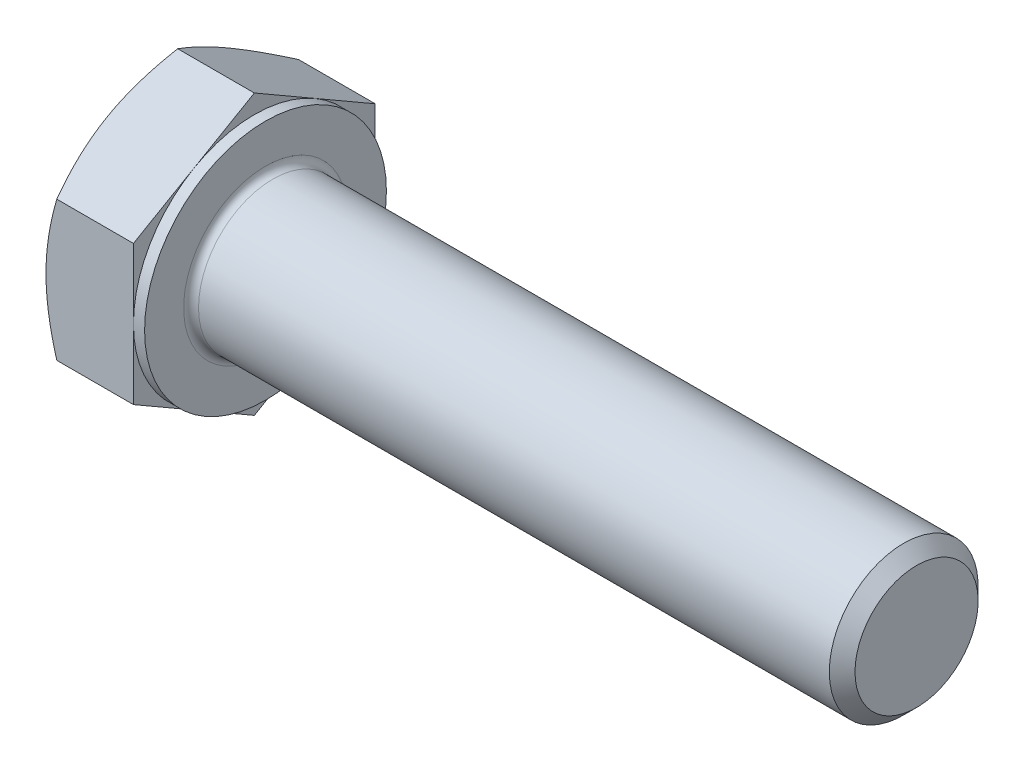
ISO-10303-21;
HEADER;
FILE_DESCRIPTION(('STEP AP214'),'2;1');
FILE_NAME('part.step','',(''),(''),'','','');
FILE_SCHEMA(('AUTOMOTIVE_DESIGN { 1 0 10303 214 1 1 1 1 }'));
ENDSEC;
DATA;
#1=APPLICATION_CONTEXT('core data for automotive mechanical design processes');
#2=APPLICATION_PROTOCOL_DEFINITION('international standard','automotive_design',2000,#1);
#3=PRODUCT_CONTEXT('',#1,'mechanical');
#4=PRODUCT('Part','Part','',(#3));
#5=PRODUCT_RELATED_PRODUCT_CATEGORY('part','',(#4));
#6=PRODUCT_DEFINITION_FORMATION('','',#4);
#7=PRODUCT_DEFINITION_CONTEXT('part definition',#1,'design');
#8=PRODUCT_DEFINITION('design','',#6,#7);
#9=PRODUCT_DEFINITION_SHAPE('','',#8);
#10=(LENGTH_UNIT() NAMED_UNIT(*) SI_UNIT(.MILLI.,.METRE.));
#11=(NAMED_UNIT(*) PLANE_ANGLE_UNIT() SI_UNIT($,.RADIAN.));
#12=(NAMED_UNIT(*) SI_UNIT($,.STERADIAN.) SOLID_ANGLE_UNIT());
#13=UNCERTAINTY_MEASURE_WITH_UNIT(LENGTH_MEASURE(1.E-05),#10,'distance_accuracy_value','');
#14=(GEOMETRIC_REPRESENTATION_CONTEXT(3) GLOBAL_UNCERTAINTY_ASSIGNED_CONTEXT((#13)) GLOBAL_UNIT_ASSIGNED_CONTEXT((#10,
#11,#12)) REPRESENTATION_CONTEXT('',''));
#15=CARTESIAN_POINT('',(0.,0.,0.));
#16=DIRECTION('',(0.,0.,1.));
#17=DIRECTION('',(1.,0.,0.));
#18=AXIS2_PLACEMENT_3D('',#15,#16,#17);
#19=CARTESIAN_POINT('',(5.3,7.50555349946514,0.));
#20=DIRECTION('',(1.,0.,0.));
#21=DIRECTION('',(0.,0.,-1.));
#22=AXIS2_PLACEMENT_3D('',#19,#20,#21);
#23=PLANE('',#22);
#24=CARTESIAN_POINT('',(5.3,0.,0.));
#25=DIRECTION('',(1.,0.,0.));
#26=DIRECTION('',(0.,0.,-1.));
#27=AXIS2_PLACEMENT_3D('',#24,#25,#26);
#28=CIRCLE('',#27,4.4);
#29=CARTESIAN_POINT('',(5.3,0.,-4.4));
#30=VERTEX_POINT('',#29);
#31=EDGE_CURVE('E38',#30,#30,#28,.F.);
#32=ORIENTED_EDGE('',*,*,#31,.T.);
#33=EDGE_LOOP('',(#32));
#34=FACE_BOUND('',#33,.T.);
#35=CARTESIAN_POINT('',(5.3,0.,0.));
#36=DIRECTION('',(1.,0.,0.));
#37=DIRECTION('',(0.,0.,-1.));
#38=AXIS2_PLACEMENT_3D('',#35,#36,#37);
#39=CIRCLE('',#38,6.5);
#40=CARTESIAN_POINT('',(5.3,0.,-6.5));
#41=VERTEX_POINT('',#40);
#42=EDGE_CURVE('E289',#41,#41,#39,.T.);
#43=ORIENTED_EDGE('',*,*,#42,.T.);
#44=EDGE_LOOP('',(#43));
#45=FACE_BOUND('',#44,.T.);
#46=ADVANCED_FACE('F30',(#34,#45),#23,.T.);
#47=CARTESIAN_POINT('',(0.,0.,0.));
#48=DIRECTION('',(-1.,0.,0.));
#49=DIRECTION('',(0.,0.,1.));
#50=AXIS2_PLACEMENT_3D('',#47,#48,#49);
#51=CYLINDRICAL_SURFACE('',#50,4.);
#52=CARTESIAN_POINT('',(5.7,0.,0.));
#53=DIRECTION('',(1.,0.,0.));
#54=DIRECTION('',(0.,0.,-1.));
#55=AXIS2_PLACEMENT_3D('',#52,#53,#54);
#56=CIRCLE('',#55,4.);
#57=CARTESIAN_POINT('',(5.7,0.,-4.));
#58=VERTEX_POINT('',#57);
#59=EDGE_CURVE('E11',#58,#58,#56,.T.);
#60=ORIENTED_EDGE('',*,*,#59,.T.);
#61=EDGE_LOOP('',(#60));
#62=FACE_BOUND('',#61,.T.);
#63=CARTESIAN_POINT('',(39.6095,0.,0.));
#64=DIRECTION('',(-1.,0.,0.));
#65=DIRECTION('',(0.,0.,1.));
#66=AXIS2_PLACEMENT_3D('',#63,#64,#65);
#67=CIRCLE('',#66,4.);
#68=CARTESIAN_POINT('',(39.6095,0.,4.));
#69=VERTEX_POINT('',#68);
#70=EDGE_CURVE('E268',#69,#69,#67,.T.);
#71=ORIENTED_EDGE('',*,*,#70,.T.);
#72=EDGE_LOOP('',(#71));
#73=FACE_BOUND('',#72,.T.);
#74=ADVANCED_FACE('F242',(#62,#73),#51,.T.);
#75=CARTESIAN_POINT('',(40.3,0.,0.));
#76=DIRECTION('',(-1.,0.,0.));
#77=DIRECTION('',(0.,0.,1.));
#78=AXIS2_PLACEMENT_3D('',#75,#76,#77);
#79=CONICAL_SURFACE('',#78,3.3095,0.785398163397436);
#80=ORIENTED_EDGE('',*,*,#70,.F.);
#81=EDGE_LOOP('',(#80));
#82=FACE_BOUND('',#81,.T.);
#83=CARTESIAN_POINT('',(40.3,0.,0.));
#84=DIRECTION('',(-1.,0.,0.));
#85=DIRECTION('',(0.,0.,1.));
#86=AXIS2_PLACEMENT_3D('',#83,#84,#85);
#87=CIRCLE('',#86,3.3095);
#88=CARTESIAN_POINT('',(40.3,0.,3.3095));
#89=VERTEX_POINT('',#88);
#90=EDGE_CURVE('E266',#89,#89,#87,.T.);
#91=ORIENTED_EDGE('',*,*,#90,.T.);
#92=EDGE_LOOP('',(#91));
#93=FACE_BOUND('',#92,.T.);
#94=ADVANCED_FACE('F247',(#82,#93),#79,.T.);
#95=CARTESIAN_POINT('',(40.3,0.,0.));
#96=DIRECTION('',(-1.,0.,0.));
#97=DIRECTION('',(0.,0.,1.));
#98=AXIS2_PLACEMENT_3D('',#95,#96,#97);
#99=PLANE('',#98);
#100=ORIENTED_EDGE('',*,*,#90,.F.);
#101=EDGE_LOOP('',(#100));
#102=FACE_BOUND('',#101,.T.);
#103=ADVANCED_FACE('F254',(#102),#99,.F.);
#104=CARTESIAN_POINT('',(4.7,6.5,0.));
#105=DIRECTION('',(1.,0.,0.));
#106=DIRECTION('',(0.,0.,-1.));
#107=AXIS2_PLACEMENT_3D('',#104,#105,#106);
#108=PLANE('',#107);
#109=DIRECTION('',(0.,0.500000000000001,0.866025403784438));
#110=VECTOR('',#109,1.);
#111=CARTESIAN_POINT('',(4.7,3.75277674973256,-6.5));
#112=LINE('',#111,#110);
#113=CARTESIAN_POINT('',(4.7,3.75277674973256,-6.5));
#114=VERTEX_POINT('',#113);
#115=CARTESIAN_POINT('',(4.7,5.62916512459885,-3.25000000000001));
#116=VERTEX_POINT('',#115);
#117=EDGE_CURVE('E162',#114,#116,#112,.T.);
#118=ORIENTED_EDGE('',*,*,#117,.T.);
#119=CARTESIAN_POINT('',(4.7,0.,0.));
#120=DIRECTION('',(-1.,0.,0.));
#121=DIRECTION('',(0.,0.,1.));
#122=AXIS2_PLACEMENT_3D('',#119,#120,#121);
#123=CIRCLE('',#122,6.5);
#124=CARTESIAN_POINT('',(4.7,0.,-6.5));
#125=VERTEX_POINT('',#124);
#126=EDGE_CURVE('E45',#116,#125,#123,.T.);
#127=ORIENTED_EDGE('',*,*,#126,.T.);
#128=DIRECTION('',(0.,1.,0.));
#129=VECTOR('',#128,1.);
#130=CARTESIAN_POINT('',(4.7,3.75277674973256,-6.5));
#131=LINE('',#130,#129);
#132=EDGE_CURVE('E292',#125,#114,#131,.T.);
#133=ORIENTED_EDGE('',*,*,#132,.T.);
#134=EDGE_LOOP('',(#118,#127,#133));
#135=FACE_BOUND('',#134,.T.);
#136=ADVANCED_FACE('F257',(#135),#108,.T.);
#137=CARTESIAN_POINT('',(4.7,7.50555349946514,0.));
#138=VERTEX_POINT('',#137);
#139=EDGE_CURVE('E160',#116,#138,#112,.T.);
#140=ORIENTED_EDGE('',*,*,#139,.T.);
#141=DIRECTION('',(0.,-0.500000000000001,0.866025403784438));
#142=VECTOR('',#141,1.);
#143=CARTESIAN_POINT('',(4.7,7.50555349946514,0.));
#144=LINE('',#143,#142);
#145=CARTESIAN_POINT('',(4.7,5.62916512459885,3.25000000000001));
#146=VERTEX_POINT('',#145);
#147=EDGE_CURVE('E159',#138,#146,#144,.T.);
#148=ORIENTED_EDGE('',*,*,#147,.T.);
#149=EDGE_CURVE('E148',#146,#116,#123,.T.);
#150=ORIENTED_EDGE('',*,*,#149,.T.);
#151=EDGE_LOOP('',(#140,#148,#150));
#152=FACE_BOUND('',#151,.T.);
#153=ADVANCED_FACE('F262',(#152),#108,.T.);
#154=CARTESIAN_POINT('',(4.7,3.75277674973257,6.5));
#155=VERTEX_POINT('',#154);
#156=EDGE_CURVE('E127',#146,#155,#144,.T.);
#157=ORIENTED_EDGE('',*,*,#156,.T.);
#158=DIRECTION('',(0.,-1.,0.));
#159=VECTOR('',#158,1.);
#160=CARTESIAN_POINT('',(4.7,3.75277674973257,6.5));
#161=LINE('',#160,#159);
#162=CARTESIAN_POINT('',(4.7,0.,6.5));
#163=VERTEX_POINT('',#162);
#164=EDGE_CURVE('E121',#155,#163,#161,.T.);
#165=ORIENTED_EDGE('',*,*,#164,.T.);
#166=EDGE_CURVE('E125',#163,#146,#123,.T.);
#167=ORIENTED_EDGE('',*,*,#166,.T.);
#168=EDGE_LOOP('',(#157,#165,#167));
#169=FACE_BOUND('',#168,.T.);
#170=ADVANCED_FACE('F123',(#169),#108,.T.);
#171=CARTESIAN_POINT('',(4.7,-3.75277674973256,6.5));
#172=VERTEX_POINT('',#171);
#173=EDGE_CURVE('E131',#163,#172,#161,.T.);
#174=ORIENTED_EDGE('',*,*,#173,.T.);
#175=DIRECTION('',(0.,-0.500000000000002,-0.866025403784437));
#176=VECTOR('',#175,1.);
#177=CARTESIAN_POINT('',(4.7,-7.50555349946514,0.));
#178=LINE('',#177,#176);
#179=CARTESIAN_POINT('',(4.7,-5.62916512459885,3.25000000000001));
#180=VERTEX_POINT('',#179);
#181=EDGE_CURVE('E138',#172,#180,#178,.T.);
#182=ORIENTED_EDGE('',*,*,#181,.T.);
#183=EDGE_CURVE('E135',#180,#163,#123,.T.);
#184=ORIENTED_EDGE('',*,*,#183,.T.);
#185=EDGE_LOOP('',(#174,#182,#184));
#186=FACE_BOUND('',#185,.T.);
#187=ADVANCED_FACE('F136',(#186),#108,.T.);
#188=CARTESIAN_POINT('',(4.7,-7.50555349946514,0.));
#189=VERTEX_POINT('',#188);
#190=EDGE_CURVE('E154',#180,#189,#178,.T.);
#191=ORIENTED_EDGE('',*,*,#190,.T.);
#192=DIRECTION('',(0.,0.5,-0.866025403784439));
#193=VECTOR('',#192,1.);
#194=CARTESIAN_POINT('',(4.7,-3.75277674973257,-6.5));
#195=LINE('',#194,#193);
#196=CARTESIAN_POINT('',(4.7,-5.62916512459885,-3.25));
#197=VERTEX_POINT('',#196);
#198=EDGE_CURVE('E330',#189,#197,#195,.T.);
#199=ORIENTED_EDGE('',*,*,#198,.T.);
#200=EDGE_CURVE('E142',#197,#180,#123,.T.);
#201=ORIENTED_EDGE('',*,*,#200,.T.);
#202=EDGE_LOOP('',(#191,#199,#201));
#203=FACE_BOUND('',#202,.T.);
#204=ADVANCED_FACE('F331',(#203),#108,.T.);
#205=CARTESIAN_POINT('',(4.7,-3.75277674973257,-6.5));
#206=VERTEX_POINT('',#205);
#207=EDGE_CURVE('E149',#197,#206,#195,.T.);
#208=ORIENTED_EDGE('',*,*,#207,.T.);
#209=EDGE_CURVE('E293',#206,#125,#131,.T.);
#210=ORIENTED_EDGE('',*,*,#209,.T.);
#211=EDGE_CURVE('E300',#125,#197,#123,.T.);
#212=ORIENTED_EDGE('',*,*,#211,.T.);
#213=EDGE_LOOP('',(#208,#210,#212));
#214=FACE_BOUND('',#213,.T.);
#215=ADVANCED_FACE('F263',(#214),#108,.T.);
#216=CARTESIAN_POINT('',(0.,0.,0.));
#217=DIRECTION('',(-1.,0.,0.));
#218=DIRECTION('',(0.,0.,1.));
#219=AXIS2_PLACEMENT_3D('',#216,#217,#218);
#220=CYLINDRICAL_SURFACE('',#219,6.5);
#221=ORIENTED_EDGE('',*,*,#126,.F.);
#222=ORIENTED_EDGE('',*,*,#149,.F.);
#223=ORIENTED_EDGE('',*,*,#166,.F.);
#224=ORIENTED_EDGE('',*,*,#183,.F.);
#225=ORIENTED_EDGE('',*,*,#200,.F.);
#226=ORIENTED_EDGE('',*,*,#211,.F.);
#227=EDGE_LOOP('',(#221,#222,#223,#224,#225,#226));
#228=FACE_BOUND('',#227,.T.);
#229=ORIENTED_EDGE('',*,*,#42,.F.);
#230=EDGE_LOOP('',(#229));
#231=FACE_BOUND('',#230,.T.);
#232=ADVANCED_FACE('F145',(#228,#231),#220,.T.);
#233=CARTESIAN_POINT('',(0.,7.50555349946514,0.));
#234=DIRECTION('',(1.,0.,0.));
#235=DIRECTION('',(0.,0.,-1.));
#236=AXIS2_PLACEMENT_3D('',#233,#234,#235);
#237=PLANE('',#236);
#238=CARTESIAN_POINT('',(0.,0.,0.));
#239=DIRECTION('',(1.,0.,0.));
#240=DIRECTION('',(0.,0.,-1.));
#241=AXIS2_PLACEMENT_3D('',#238,#239,#240);
#242=CIRCLE('',#241,6.5);
#243=CARTESIAN_POINT('',(0.,0.,-6.5));
#244=VERTEX_POINT('',#243);
#245=CARTESIAN_POINT('',(0.,5.62916512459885,-3.25000000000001));
#246=VERTEX_POINT('',#245);
#247=EDGE_CURVE('E288',#244,#246,#242,.T.);
#248=ORIENTED_EDGE('',*,*,#247,.F.);
#249=CARTESIAN_POINT('',(0.,-5.62916512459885,-3.25));
#250=VERTEX_POINT('',#249);
#251=EDGE_CURVE('E284',#250,#244,#242,.T.);
#252=ORIENTED_EDGE('',*,*,#251,.F.);
#253=CARTESIAN_POINT('',(0.,-5.62916512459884,3.25000000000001));
#254=VERTEX_POINT('',#253);
#255=EDGE_CURVE('E287',#254,#250,#242,.T.);
#256=ORIENTED_EDGE('',*,*,#255,.F.);
#257=CARTESIAN_POINT('',(0.,0.,6.5));
#258=VERTEX_POINT('',#257);
#259=EDGE_CURVE('E323',#258,#254,#242,.T.);
#260=ORIENTED_EDGE('',*,*,#259,.F.);
#261=CARTESIAN_POINT('',(0.,0.,0.));
#262=DIRECTION('',(-1.,0.,0.));
#263=DIRECTION('',(0.,0.,1.));
#264=AXIS2_PLACEMENT_3D('',#261,#262,#263);
#265=CIRCLE('',#264,6.5);
#266=CARTESIAN_POINT('',(0.,5.62916512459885,3.25));
#267=VERTEX_POINT('',#266);
#268=EDGE_CURVE('E163',#258,#267,#265,.T.);
#269=ORIENTED_EDGE('',*,*,#268,.T.);
#270=EDGE_CURVE('E346',#246,#267,#242,.T.);
#271=ORIENTED_EDGE('',*,*,#270,.F.);
#272=EDGE_LOOP('',(#248,#252,#256,#260,#269,#271));
#273=FACE_BOUND('',#272,.T.);
#274=ADVANCED_FACE('F192',(#273),#237,.F.);
#275=CARTESIAN_POINT('',(0.,0.,0.));
#276=DIRECTION('',(1.,0.,0.));
#277=DIRECTION('',(0.,0.,-1.));
#278=AXIS2_PLACEMENT_3D('',#275,#276,#277);
#279=CONICAL_SURFACE('',#278,6.5,1.0471975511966);
#280=CARTESIAN_POINT('',(0.580623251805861,3.75266127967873,6.5002));
#281=CARTESIAN_POINT('',(0.53300442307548,3.8351516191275,6.35732254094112));
#282=CARTESIAN_POINT('',(0.487546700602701,3.91794952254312,6.21391236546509));
#283=CARTESIAN_POINT('',(0.401548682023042,4.08421773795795,5.9259273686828));
#284=CARTESIAN_POINT('',(0.361010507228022,4.16768832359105,5.78135207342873));
#285=CARTESIAN_POINT('',(0.247571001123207,4.41943655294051,5.34531134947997));
#286=CARTESIAN_POINT('',(0.183047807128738,4.58870793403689,5.05212471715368));
#287=CARTESIAN_POINT('',(0.107386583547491,4.84201947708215,4.61337625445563));
#288=CARTESIAN_POINT('',(0.0858328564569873,4.92530276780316,4.46912536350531));
#289=CARTESIAN_POINT('',(0.0496903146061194,5.09224566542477,4.17997178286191));
#290=CARTESIAN_POINT('',(0.0351008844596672,5.17590523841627,4.03506915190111));
#291=CARTESIAN_POINT('',(0.0132587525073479,5.34336968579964,3.74501222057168));
#292=CARTESIAN_POINT('',(0.00599772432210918,5.427174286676,3.59985839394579));
#293=CARTESIAN_POINT('',(-0.00103969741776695,5.59485627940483,3.30942466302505));
#294=CARTESIAN_POINT('',(-0.00081632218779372,5.6787336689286,3.16414476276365));
#295=CARTESIAN_POINT('',(0.0100834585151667,5.90853103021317,2.76612405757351));
#296=CARTESIAN_POINT('',(0.0283818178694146,6.05437578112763,2.51351353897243));
#297=CARTESIAN_POINT('',(0.0864063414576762,6.34509659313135,2.00997032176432));
#298=CARTESIAN_POINT('',(0.126152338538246,6.48997163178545,1.75903939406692));
#299=CARTESIAN_POINT('',(0.22550590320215,6.78127752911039,1.25448277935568));
#300=CARTESIAN_POINT('',(0.285534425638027,6.92767163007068,1.00092075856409));
#301=CARTESIAN_POINT('',(0.421774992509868,7.21827667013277,0.497578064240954));
#302=CARTESIAN_POINT('',(0.497955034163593,7.36249133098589,0.247790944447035));
#303=CARTESIAN_POINT('',(0.580623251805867,7.50566896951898,-0.000200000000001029));
#304=B_SPLINE_CURVE_WITH_KNOTS('',3,(#280,#281,#282,#283,#284,#285,#286,#287,#288,#289,#290,
#291,#292,#293,#294,#295,#296,#297,#298,#299,#300,#301,#302,#303),.UNSPECIFIED.,.F.,.F.,(4,2,2,
2,2,2,2,2,2,2,2,4),(0.,0.515105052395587,1.03043143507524,2.06322554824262,2.56697389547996,
3.07067772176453,3.57380860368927,4.07692394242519,4.9527935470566,5.82947446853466,
6.72559912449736,7.61996451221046),.UNSPECIFIED.);
#305=CARTESIAN_POINT('',(0.580556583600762,7.50555349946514,0.));
#306=VERTEX_POINT('',#305);
#307=EDGE_CURVE('E211',#267,#306,#304,.T.);
#308=ORIENTED_EDGE('',*,*,#307,.T.);
#309=CARTESIAN_POINT('',(0.580623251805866,7.50566896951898,0.000200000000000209));
#310=CARTESIAN_POINT('',(0.533004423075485,7.4231786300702,-0.14267745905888));
#311=CARTESIAN_POINT('',(0.487546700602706,7.34038072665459,-0.286087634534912));
#312=CARTESIAN_POINT('',(0.401548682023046,7.17411251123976,-0.574072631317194));
#313=CARTESIAN_POINT('',(0.361010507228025,7.09064192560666,-0.718647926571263));
#314=CARTESIAN_POINT('',(0.247571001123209,6.83889369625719,-1.15468865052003));
#315=CARTESIAN_POINT('',(0.18304780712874,6.66962231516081,-1.44787528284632));
#316=CARTESIAN_POINT('',(0.107386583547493,6.41631077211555,-1.88662374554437));
#317=CARTESIAN_POINT('',(0.085832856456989,6.33302748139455,-2.03087463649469));
#318=CARTESIAN_POINT('',(0.0496903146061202,6.16608458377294,-2.32002821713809));
#319=CARTESIAN_POINT('',(0.0351008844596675,6.08242501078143,-2.46493084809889));
#320=CARTESIAN_POINT('',(0.0132587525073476,5.91496056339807,-2.75498777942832));
#321=CARTESIAN_POINT('',(0.00599772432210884,5.83115596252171,-2.90014160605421));
#322=CARTESIAN_POINT('',(-0.00103969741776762,5.66347396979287,-3.19057533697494));
#323=CARTESIAN_POINT('',(-0.000816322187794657,5.5795965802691,-3.33585523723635));
#324=CARTESIAN_POINT('',(0.0100834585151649,5.34979921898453,-3.73387594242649));
#325=CARTESIAN_POINT('',(0.028381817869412,5.20395446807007,-3.98648646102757));
#326=CARTESIAN_POINT('',(0.0864063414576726,4.91323365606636,-4.49002967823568));
#327=CARTESIAN_POINT('',(0.126152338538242,4.76835861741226,-4.74096060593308));
#328=CARTESIAN_POINT('',(0.225505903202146,4.47705272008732,-5.24551722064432));
#329=CARTESIAN_POINT('',(0.285534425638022,4.33065861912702,-5.49907924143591));
#330=CARTESIAN_POINT('',(0.421774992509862,4.04005357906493,-6.00242193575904));
#331=CARTESIAN_POINT('',(0.497955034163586,3.89583891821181,-6.25220905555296));
#332=CARTESIAN_POINT('',(0.58062325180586,3.75266127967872,-6.5002));
#333=B_SPLINE_CURVE_WITH_KNOTS('',3,(#309,#310,#311,#312,#313,#314,#315,#316,#317,#318,#319,
#320,#321,#322,#323,#324,#325,#326,#327,#328,#329,#330,#331,#332),.UNSPECIFIED.,.F.,.F.,(4,2,2,
2,2,2,2,2,2,2,2,4),(0.,0.515105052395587,1.03043143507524,2.06322554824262,2.56697389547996,
3.07067772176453,3.57380860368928,4.0769239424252,4.9527935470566,5.82947446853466,
6.72559912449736,7.61996451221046),.UNSPECIFIED.);
#334=EDGE_CURVE('E53',#306,#246,#333,.T.);
#335=ORIENTED_EDGE('',*,*,#334,.T.);
#336=ORIENTED_EDGE('',*,*,#270,.T.);
#337=EDGE_LOOP('',(#308,#335,#336));
#338=FACE_BOUND('',#337,.T.);
#339=ADVANCED_FACE('F347',(#338),#279,.T.);
#340=CARTESIAN_POINT('',(3.18835311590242,-10.1137456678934,6.5));
#341=CARTESIAN_POINT('',(3.05034774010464,-9.82952666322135,6.5));
#342=CARTESIAN_POINT('',(2.91365616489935,-9.54465869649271,6.5));
#343=CARTESIAN_POINT('',(2.64363899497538,-8.97327978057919,6.5));
#344=CARTESIAN_POINT('',(2.51031392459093,-8.68676858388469,6.5));
#345=CARTESIAN_POINT('',(2.24710473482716,-8.11029837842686,6.5));
#346=CARTESIAN_POINT('',(2.11724300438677,-7.82032911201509,6.5));
#347=CARTESIAN_POINT('',(1.862790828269,-7.23809541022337,6.5));
#348=CARTESIAN_POINT('',(1.73820013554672,-6.94583108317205,6.5));
#349=CARTESIAN_POINT('',(1.49176685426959,-6.34906440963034,6.5));
#350=CARTESIAN_POINT('',(1.37014257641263,-6.0444714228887,6.5));
#351=CARTESIAN_POINT('',(1.13601865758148,-5.43173420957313,6.5));
#352=CARTESIAN_POINT('',(1.02352003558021,-5.12358959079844,6.5));
#353=CARTESIAN_POINT('',(0.810575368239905,-4.50382569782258,6.5));
#354=CARTESIAN_POINT('',(0.710105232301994,-4.19221478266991,6.5));
#355=CARTESIAN_POINT('',(0.524420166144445,-3.5645201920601,6.5));
#356=CARTESIAN_POINT('',(0.43920046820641,-3.24843794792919,6.5));
#357=CARTESIAN_POINT('',(0.288524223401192,-2.61335465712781,6.5));
#358=CARTESIAN_POINT('',(0.222961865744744,-2.29437912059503,6.5));
#359=CARTESIAN_POINT('',(0.115312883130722,-1.65238219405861,6.5));
#360=CARTESIAN_POINT('',(0.0732239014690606,-1.32936121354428,6.5));
#361=CARTESIAN_POINT('',(0.0304887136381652,-0.845231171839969,6.5));
#362=CARTESIAN_POINT('',(0.0196493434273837,-0.684982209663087,6.5));
#363=CARTESIAN_POINT('',(0.00475298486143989,-0.364162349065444,6.5));
#364=CARTESIAN_POINT('',(0.000695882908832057,-0.203591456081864,6.5));
#365=CARTESIAN_POINT('',(-0.000531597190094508,0.117577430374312,6.5));
#366=CARTESIAN_POINT('',(0.00229809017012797,0.278175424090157,6.5));
#367=CARTESIAN_POINT('',(0.0147726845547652,0.599108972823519,6.5));
#368=CARTESIAN_POINT('',(0.0244179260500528,0.759444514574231,6.5));
#369=CARTESIAN_POINT('',(0.0554961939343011,1.14369946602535,6.5));
#370=CARTESIAN_POINT('',(0.0801030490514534,1.36736763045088,6.5));
#371=CARTESIAN_POINT('',(0.14124653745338,1.8130559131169,6.5));
#372=CARTESIAN_POINT('',(0.177784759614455,2.03507580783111,6.5));
#373=CARTESIAN_POINT('',(0.30336000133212,2.69839633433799,6.5));
#374=CARTESIAN_POINT('',(0.408335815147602,3.13672010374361,6.5));
#375=CARTESIAN_POINT('',(0.59056459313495,3.79232112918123,6.5));
#376=CARTESIAN_POINT('',(0.656313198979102,4.01299150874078,6.5));
#377=CARTESIAN_POINT('',(0.794681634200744,4.45218859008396,6.5));
#378=CARTESIAN_POINT('',(0.86730151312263,4.67071527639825,6.5));
#379=CARTESIAN_POINT('',(1.01824353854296,5.10569490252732,6.5));
#380=CARTESIAN_POINT('',(1.0965638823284,5.32214847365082,6.5));
#381=CARTESIAN_POINT('',(1.25798086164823,5.75325725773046,6.5));
#382=CARTESIAN_POINT('',(1.34107741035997,5.96791250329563,6.5));
#383=CARTESIAN_POINT('',(1.56029019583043,6.5188844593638,6.5));
#384=CARTESIAN_POINT('',(1.69936356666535,6.85402316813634,6.5));
#385=CARTESIAN_POINT('',(1.98501958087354,7.521095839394,6.5));
#386=CARTESIAN_POINT('',(2.13160288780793,7.85302951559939,6.5));
#387=CARTESIAN_POINT('',(2.43059748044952,8.51437865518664,6.5));
#388=CARTESIAN_POINT('',(2.5830105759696,8.843793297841,6.5));
#389=CARTESIAN_POINT('',(2.89234869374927,9.5004779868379,6.5));
#390=CARTESIAN_POINT('',(3.04927357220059,9.82774810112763,6.5));
#391=CARTESIAN_POINT('',(3.36692013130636,10.4809971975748,6.5));
#392=CARTESIAN_POINT('',(3.52764676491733,10.8069737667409,6.5));
#393=CARTESIAN_POINT('',(3.85198555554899,11.4574882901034,6.5));
#394=CARTESIAN_POINT('',(4.01559773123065,11.7820262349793,6.5));
#395=CARTESIAN_POINT('',(4.50986185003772,12.7537468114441,6.5));
#396=CARTESIAN_POINT('',(4.84399997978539,13.3991555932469,6.5));
#397=CARTESIAN_POINT('',(5.48575990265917,14.6239779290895,6.5));
#398=CARTESIAN_POINT('',(5.79279643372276,15.2036995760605,6.5));
#399=CARTESIAN_POINT('',(6.41069188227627,16.3611382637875,6.5));
#400=CARTESIAN_POINT('',(6.72155099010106,16.9388552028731,6.49999999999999));
#401=CARTESIAN_POINT('',(7.34519775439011,18.0910273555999,6.49999999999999));
#402=CARTESIAN_POINT('',(7.6579769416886,18.6654871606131,6.49999999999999));
#403=CARTESIAN_POINT('',(8.28574397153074,19.8131486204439,6.49999999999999));
#404=CARTESIAN_POINT('',(8.60073166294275,20.3863503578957,6.49999999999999));
#405=CARTESIAN_POINT('',(8.91652967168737,20.9591024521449,6.49999999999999));
#406=B_SPLINE_CURVE_WITH_KNOTS('',3,(#340,#341,#342,#343,#344,#345,#346,#347,#348,#349,#350,
#351,#352,#353,#354,#355,#356,#357,#358,#359,#360,#361,#362,#363,#364,#365,#366,#367,#368,#369,
#370,#371,#372,#373,#374,#375,#376,#377,#378,#379,#380,#381,#382,#383,#384,#385,#386,#387,#388,
#389,#390,#391,#392,#393,#394,#395,#396,#397,#398,#399,#400,#401,#402,#403,#404,#405),
.UNSPECIFIED.,.F.,.F.,(4,2,2,2,2,2,2,2,2,2,2,2,2,2,2,2,2,2,2,2,2,2,2,2,2,2,2,2,2,2,2,2,4),(0.,
0.947868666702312,1.89588406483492,2.84900320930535,3.80207763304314,4.7858977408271,
5.76982755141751,6.75175256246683,7.73337005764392,8.70960474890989,9.68574140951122,
10.1674651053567,10.6491807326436,11.1309009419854,11.6126447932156,12.287317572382,
12.9620802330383,14.312318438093,15.0030310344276,15.6937486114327,16.3842486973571,
17.0747362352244,18.1631508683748,19.2516618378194,20.3405135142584,21.429330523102,
22.5196540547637,23.6099846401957,25.7902468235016,27.7582608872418,29.7263733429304,
31.6886408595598,33.6507753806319),.UNSPECIFIED.);
#407=CARTESIAN_POINT('',(0.580556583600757,3.75277674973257,6.5));
#408=VERTEX_POINT('',#407);
#409=EDGE_CURVE('E223',#258,#408,#406,.T.);
#410=ORIENTED_EDGE('',*,*,#409,.T.);
#411=EDGE_CURVE('E222',#408,#267,#304,.T.);
#412=ORIENTED_EDGE('',*,*,#411,.T.);
#413=ORIENTED_EDGE('',*,*,#268,.F.);
#414=EDGE_LOOP('',(#410,#412,#413));
#415=FACE_BOUND('',#414,.T.);
#416=ADVANCED_FACE('F317',(#415),#279,.T.);
#417=CARTESIAN_POINT('',(0.580556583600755,-3.75277674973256,6.5));
#418=VERTEX_POINT('',#417);
#419=EDGE_CURVE('E269',#418,#258,#406,.T.);
#420=ORIENTED_EDGE('',*,*,#419,.T.);
#421=ORIENTED_EDGE('',*,*,#259,.T.);
#422=CARTESIAN_POINT('',(0.580623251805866,-7.50566896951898,-0.000200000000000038));
#423=CARTESIAN_POINT('',(0.533004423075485,-7.4231786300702,0.14267745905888));
#424=CARTESIAN_POINT('',(0.487546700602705,-7.34038072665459,0.286087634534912));
#425=CARTESIAN_POINT('',(0.401548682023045,-7.17411251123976,0.574072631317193));
#426=CARTESIAN_POINT('',(0.361010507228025,-7.09064192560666,0.718647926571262));
#427=CARTESIAN_POINT('',(0.247571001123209,-6.83889369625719,1.15468865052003));
#428=CARTESIAN_POINT('',(0.18304780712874,-6.66962231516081,1.44787528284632));
#429=CARTESIAN_POINT('',(0.107386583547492,-6.41631077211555,1.88662374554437));
#430=CARTESIAN_POINT('',(0.085832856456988,-6.33302748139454,2.03087463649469));
#431=CARTESIAN_POINT('',(0.0496903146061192,-6.16608458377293,2.32002821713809));
#432=CARTESIAN_POINT('',(0.0351008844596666,-6.08242501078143,2.46493084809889));
#433=CARTESIAN_POINT('',(0.0132587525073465,-5.91496056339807,2.75498777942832));
#434=CARTESIAN_POINT('',(0.00599772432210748,-5.8311559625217,2.90014160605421));
#435=CARTESIAN_POINT('',(-0.00103969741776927,-5.66347396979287,3.19057533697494));
#436=CARTESIAN_POINT('',(-0.000816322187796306,-5.5795965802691,3.33585523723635));
#437=CARTESIAN_POINT('',(0.0100834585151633,-5.34979921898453,3.73387594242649));
#438=CARTESIAN_POINT('',(0.0283818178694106,-5.20395446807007,3.98648646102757));
#439=CARTESIAN_POINT('',(0.0864063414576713,-4.91323365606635,4.49002967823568));
#440=CARTESIAN_POINT('',(0.126152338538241,-4.76835861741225,4.74096060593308));
#441=CARTESIAN_POINT('',(0.225505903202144,-4.47705272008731,5.24551722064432));
#442=CARTESIAN_POINT('',(0.285534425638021,-4.33065861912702,5.49907924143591));
#443=CARTESIAN_POINT('',(0.421774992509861,-4.04005357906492,6.00242193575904));
#444=CARTESIAN_POINT('',(0.497955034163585,-3.8958389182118,6.25220905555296));
#445=CARTESIAN_POINT('',(0.580623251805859,-3.75266127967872,6.5002));
#446=B_SPLINE_CURVE_WITH_KNOTS('',3,(#422,#423,#424,#425,#426,#427,#428,#429,#430,#431,#432,
#433,#434,#435,#436,#437,#438,#439,#440,#441,#442,#443,#444,#445),.UNSPECIFIED.,.F.,.F.,(4,2,2,
2,2,2,2,2,2,2,2,4),(0.,0.515105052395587,1.03043143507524,2.06322554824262,2.56697389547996,
3.07067772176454,3.57380860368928,4.0769239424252,4.9527935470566,5.82947446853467,
6.72559912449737,7.61996451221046),.UNSPECIFIED.);
#447=EDGE_CURVE('E213',#254,#418,#446,.T.);
#448=ORIENTED_EDGE('',*,*,#447,.T.);
#449=EDGE_LOOP('',(#420,#421,#448));
#450=FACE_BOUND('',#449,.T.);
#451=ADVANCED_FACE('F181',(#450),#279,.T.);
#452=CARTESIAN_POINT('',(0.580556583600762,-7.50555349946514,0.));
#453=VERTEX_POINT('',#452);
#454=EDGE_CURVE('E206',#453,#254,#446,.T.);
#455=ORIENTED_EDGE('',*,*,#454,.T.);
#456=ORIENTED_EDGE('',*,*,#255,.T.);
#457=CARTESIAN_POINT('',(0.580623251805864,-3.75266127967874,-6.5002));
#458=CARTESIAN_POINT('',(0.533004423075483,-3.83515161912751,-6.35732254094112));
#459=CARTESIAN_POINT('',(0.487546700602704,-3.91794952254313,-6.21391236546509));
#460=CARTESIAN_POINT('',(0.401548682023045,-4.08421773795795,-5.9259273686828));
#461=CARTESIAN_POINT('',(0.361010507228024,-4.16768832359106,-5.78135207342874));
#462=CARTESIAN_POINT('',(0.247571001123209,-4.41943655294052,-5.34531134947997));
#463=CARTESIAN_POINT('',(0.18304780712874,-4.5887079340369,-5.05212471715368));
#464=CARTESIAN_POINT('',(0.107386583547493,-4.84201947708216,-4.61337625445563));
#465=CARTESIAN_POINT('',(0.0858328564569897,-4.92530276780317,-4.46912536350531));
#466=CARTESIAN_POINT('',(0.0496903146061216,-5.09224566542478,-4.17997178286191));
#467=CARTESIAN_POINT('',(0.0351008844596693,-5.17590523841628,-4.03506915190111));
#468=CARTESIAN_POINT('',(0.0132587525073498,-5.34336968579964,-3.74501222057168));
#469=CARTESIAN_POINT('',(0.00599772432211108,-5.427174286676,-3.59985839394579));
#470=CARTESIAN_POINT('',(-0.00103969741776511,-5.59485627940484,-3.30942466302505));
#471=CARTESIAN_POINT('',(-0.000816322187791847,-5.67873366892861,-3.16414476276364));
#472=CARTESIAN_POINT('',(0.0100834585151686,-5.90853103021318,-2.76612405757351));
#473=CARTESIAN_POINT('',(0.0283818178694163,-6.05437578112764,-2.51351353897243));
#474=CARTESIAN_POINT('',(0.0864063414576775,-6.34509659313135,-2.00997032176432));
#475=CARTESIAN_POINT('',(0.126152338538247,-6.48997163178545,-1.75903939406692));
#476=CARTESIAN_POINT('',(0.225505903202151,-6.78127752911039,-1.25448277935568));
#477=CARTESIAN_POINT('',(0.285534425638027,-6.92767163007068,-1.00092075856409));
#478=CARTESIAN_POINT('',(0.421774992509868,-7.21827667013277,-0.497578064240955));
#479=CARTESIAN_POINT('',(0.497955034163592,-7.36249133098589,-0.247790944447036));
#480=CARTESIAN_POINT('',(0.580623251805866,-7.50566896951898,0.000200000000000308));
#481=B_SPLINE_CURVE_WITH_KNOTS('',3,(#457,#458,#459,#460,#461,#462,#463,#464,#465,#466,#467,
#468,#469,#470,#471,#472,#473,#474,#475,#476,#477,#478,#479,#480),.UNSPECIFIED.,.F.,.F.,(4,2,2,
2,2,2,2,2,2,2,2,4),(0.,0.515105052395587,1.03043143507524,2.06322554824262,2.56697389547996,
3.07067772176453,3.57380860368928,4.0769239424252,4.9527935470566,5.82947446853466,
6.72559912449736,7.61996451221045),.UNSPECIFIED.);
#482=EDGE_CURVE('E212',#250,#453,#481,.T.);
#483=ORIENTED_EDGE('',*,*,#482,.T.);
#484=EDGE_LOOP('',(#455,#456,#483));
#485=FACE_BOUND('',#484,.T.);
#486=ADVANCED_FACE('F345',(#485),#279,.T.);
#487=CARTESIAN_POINT('',(0.580556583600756,3.75277674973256,-6.5));
#488=VERTEX_POINT('',#487);
#489=EDGE_CURVE('E214',#246,#488,#333,.T.);
#490=ORIENTED_EDGE('',*,*,#489,.T.);
#491=CARTESIAN_POINT('',(3.18835311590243,-10.1137456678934,-6.5));
#492=CARTESIAN_POINT('',(3.05034774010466,-9.82952666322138,-6.5));
#493=CARTESIAN_POINT('',(2.91365616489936,-9.54465869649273,-6.5));
#494=CARTESIAN_POINT('',(2.64363899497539,-8.97327978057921,-6.5));
#495=CARTESIAN_POINT('',(2.51031392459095,-8.68676858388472,-6.5));
#496=CARTESIAN_POINT('',(2.24710473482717,-8.11029837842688,-6.5));
#497=CARTESIAN_POINT('',(2.11724300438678,-7.82032911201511,-6.5));
#498=CARTESIAN_POINT('',(1.86279082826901,-7.23809541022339,-6.5));
#499=CARTESIAN_POINT('',(1.73820013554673,-6.94583108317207,-6.5));
#500=CARTESIAN_POINT('',(1.4917668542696,-6.34906440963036,-6.5));
#501=CARTESIAN_POINT('',(1.37014257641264,-6.04447142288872,-6.5));
#502=CARTESIAN_POINT('',(1.13601865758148,-5.43173420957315,-6.5));
#503=CARTESIAN_POINT('',(1.02352003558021,-5.12358959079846,-6.5));
#504=CARTESIAN_POINT('',(0.81057536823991,-4.50382569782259,-6.5));
#505=CARTESIAN_POINT('',(0.710105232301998,-4.19221478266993,-6.5));
#506=CARTESIAN_POINT('',(0.524420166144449,-3.56452019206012,-6.5));
#507=CARTESIAN_POINT('',(0.439200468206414,-3.2484379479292,-6.5));
#508=CARTESIAN_POINT('',(0.288524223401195,-2.61335465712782,-6.5));
#509=CARTESIAN_POINT('',(0.222961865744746,-2.29437912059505,-6.5));
#510=CARTESIAN_POINT('',(0.115312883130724,-1.65238219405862,-6.5));
#511=CARTESIAN_POINT('',(0.0732239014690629,-1.3293612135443,-6.5));
#512=CARTESIAN_POINT('',(0.0304887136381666,-0.845231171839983,-6.5));
#513=CARTESIAN_POINT('',(0.0196493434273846,-0.684982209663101,-6.5));
#514=CARTESIAN_POINT('',(0.00475298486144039,-0.364162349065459,-6.5));
#515=CARTESIAN_POINT('',(0.000695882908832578,-0.203591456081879,-6.5));
#516=CARTESIAN_POINT('',(-0.000531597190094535,0.117577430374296,-6.5));
#517=CARTESIAN_POINT('',(0.0022980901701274,0.278175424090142,-6.5));
#518=CARTESIAN_POINT('',(0.0147726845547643,0.599108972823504,-6.5));
#519=CARTESIAN_POINT('',(0.0244179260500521,0.759444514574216,-6.5));
#520=CARTESIAN_POINT('',(0.0554961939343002,1.14369946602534,-6.5));
#521=CARTESIAN_POINT('',(0.0801030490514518,1.36736763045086,-6.5));
#522=CARTESIAN_POINT('',(0.141246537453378,1.81305591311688,-6.5));
#523=CARTESIAN_POINT('',(0.177784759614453,2.03507580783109,-6.5));
#524=CARTESIAN_POINT('',(0.303360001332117,2.69839633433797,-6.5));
#525=CARTESIAN_POINT('',(0.408335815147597,3.13672010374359,-6.5));
#526=CARTESIAN_POINT('',(0.590564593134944,3.79232112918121,-6.5));
#527=CARTESIAN_POINT('',(0.656313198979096,4.01299150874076,-6.5));
#528=CARTESIAN_POINT('',(0.794681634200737,4.45218859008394,-6.5));
#529=CARTESIAN_POINT('',(0.867301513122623,4.67071527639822,-6.5));
#530=CARTESIAN_POINT('',(1.01824353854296,5.1056949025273,-6.5));
#531=CARTESIAN_POINT('',(1.0965638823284,5.3221484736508,-6.5));
#532=CARTESIAN_POINT('',(1.25798086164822,5.75325725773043,-6.5));
#533=CARTESIAN_POINT('',(1.34107741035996,5.96791250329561,-6.5));
#534=CARTESIAN_POINT('',(1.56029019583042,6.51888445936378,-6.5));
#535=CARTESIAN_POINT('',(1.69936356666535,6.85402316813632,-6.5));
#536=CARTESIAN_POINT('',(1.98501958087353,7.52109583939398,-6.5));
#537=CARTESIAN_POINT('',(2.13160288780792,7.85302951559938,-6.5));
#538=CARTESIAN_POINT('',(2.43059748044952,8.51437865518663,-6.5));
#539=CARTESIAN_POINT('',(2.58301057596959,8.84379329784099,-6.5));
#540=CARTESIAN_POINT('',(2.89234869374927,9.50047798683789,-6.5));
#541=CARTESIAN_POINT('',(3.04927357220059,9.82774810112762,-6.5));
#542=CARTESIAN_POINT('',(3.36692013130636,10.4809971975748,-6.5));
#543=CARTESIAN_POINT('',(3.52764676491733,10.8069737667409,-6.5));
#544=CARTESIAN_POINT('',(3.85198555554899,11.4574882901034,-6.5));
#545=CARTESIAN_POINT('',(4.01559773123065,11.7820262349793,-6.5));
#546=CARTESIAN_POINT('',(4.50986185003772,12.7537468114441,-6.5));
#547=CARTESIAN_POINT('',(4.84399997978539,13.3991555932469,-6.5));
#548=CARTESIAN_POINT('',(5.48575990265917,14.6239779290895,-6.5));
#549=CARTESIAN_POINT('',(5.79279643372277,15.2036995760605,-6.5));
#550=CARTESIAN_POINT('',(6.41069188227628,16.3611382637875,-6.5));
#551=CARTESIAN_POINT('',(6.72155099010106,16.9388552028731,-6.5));
#552=CARTESIAN_POINT('',(7.34519775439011,18.0910273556,-6.5));
#553=CARTESIAN_POINT('',(7.65797694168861,18.6654871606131,-6.5));
#554=CARTESIAN_POINT('',(8.28574397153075,19.8131486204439,-6.5));
#555=CARTESIAN_POINT('',(8.60073166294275,20.3863503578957,-6.5));
#556=CARTESIAN_POINT('',(8.91652967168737,20.9591024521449,-6.5));
#557=B_SPLINE_CURVE_WITH_KNOTS('',3,(#491,#492,#493,#494,#495,#496,#497,#498,#499,#500,#501,
#502,#503,#504,#505,#506,#507,#508,#509,#510,#511,#512,#513,#514,#515,#516,#517,#518,#519,#520,
#521,#522,#523,#524,#525,#526,#527,#528,#529,#530,#531,#532,#533,#534,#535,#536,#537,#538,#539,
#540,#541,#542,#543,#544,#545,#546,#547,#548,#549,#550,#551,#552,#553,#554,#555,#556),
.UNSPECIFIED.,.F.,.F.,(4,2,2,2,2,2,2,2,2,2,2,2,2,2,2,2,2,2,2,2,2,2,2,2,2,2,2,2,2,2,2,2,4),(0.,
0.947868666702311,1.89588406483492,2.84900320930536,3.80207763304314,4.7858977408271,
5.76982755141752,6.75175256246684,7.73337005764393,8.7096047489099,9.68574140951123,
10.1674651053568,10.6491807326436,11.1309009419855,11.6126447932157,12.287317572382,
12.9620802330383,14.312318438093,15.0030310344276,15.6937486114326,16.3842486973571,
17.0747362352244,18.1631508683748,19.2516618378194,20.3405135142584,21.429330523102,
22.5196540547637,23.6099846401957,25.7902468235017,27.7582608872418,29.7263733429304,
31.6886408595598,33.6507753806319),.UNSPECIFIED.);
#558=EDGE_CURVE('E174',#488,#244,#557,.F.);
#559=ORIENTED_EDGE('',*,*,#558,.T.);
#560=ORIENTED_EDGE('',*,*,#247,.T.);
#561=EDGE_LOOP('',(#490,#559,#560));
#562=FACE_BOUND('',#561,.T.);
#563=ADVANCED_FACE('F342',(#562),#279,.T.);
#564=CARTESIAN_POINT('',(0.58055658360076,-3.75277674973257,-6.5));
#565=VERTEX_POINT('',#564);
#566=EDGE_CURVE('E175',#565,#250,#481,.T.);
#567=ORIENTED_EDGE('',*,*,#566,.T.);
#568=ORIENTED_EDGE('',*,*,#251,.T.);
#569=EDGE_CURVE('E166',#244,#565,#557,.F.);
#570=ORIENTED_EDGE('',*,*,#569,.T.);
#571=EDGE_LOOP('',(#567,#568,#570));
#572=FACE_BOUND('',#571,.T.);
#573=ADVANCED_FACE('F190',(#572),#279,.T.);
#574=CARTESIAN_POINT('',(5.3,3.75277674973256,-6.5));
#575=DIRECTION('',(0.,0.,1.));
#576=DIRECTION('',(0.,-1.,0.));
#577=AXIS2_PLACEMENT_3D('',#574,#575,#576);
#578=PLANE('',#577);
#579=ORIENTED_EDGE('',*,*,#209,.F.);
#580=DIRECTION('',(-1.,0.,0.));
#581=VECTOR('',#580,1.);
#582=CARTESIAN_POINT('',(5.3,-3.75277674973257,-6.5));
#583=LINE('',#582,#581);
#584=EDGE_CURVE('E275',#206,#565,#583,.T.);
#585=ORIENTED_EDGE('',*,*,#584,.T.);
#586=ORIENTED_EDGE('',*,*,#569,.F.);
#587=ORIENTED_EDGE('',*,*,#558,.F.);
#588=DIRECTION('',(-1.,0.,0.));
#589=VECTOR('',#588,1.);
#590=CARTESIAN_POINT('',(5.3,3.75277674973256,-6.5));
#591=LINE('',#590,#589);
#592=EDGE_CURVE('E271',#114,#488,#591,.T.);
#593=ORIENTED_EDGE('',*,*,#592,.F.);
#594=ORIENTED_EDGE('',*,*,#132,.F.);
#595=EDGE_LOOP('',(#579,#585,#586,#587,#593,#594));
#596=FACE_BOUND('',#595,.T.);
#597=ADVANCED_FACE('F185',(#596),#578,.F.);
#598=CARTESIAN_POINT('',(5.3,-3.75277674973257,-6.5));
#599=DIRECTION('',(0.,0.866025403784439,0.5));
#600=DIRECTION('',(0.,-0.5,0.866025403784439));
#601=AXIS2_PLACEMENT_3D('',#598,#599,#600);
#602=PLANE('',#601);
#603=ORIENTED_EDGE('',*,*,#198,.F.);
#604=DIRECTION('',(-1.,0.,0.));
#605=VECTOR('',#604,1.);
#606=CARTESIAN_POINT('',(5.3,-7.50555349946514,0.));
#607=LINE('',#606,#605);
#608=EDGE_CURVE('E277',#189,#453,#607,.T.);
#609=ORIENTED_EDGE('',*,*,#608,.T.);
#610=ORIENTED_EDGE('',*,*,#482,.F.);
#611=ORIENTED_EDGE('',*,*,#566,.F.);
#612=ORIENTED_EDGE('',*,*,#584,.F.);
#613=ORIENTED_EDGE('',*,*,#207,.F.);
#614=EDGE_LOOP('',(#603,#609,#610,#611,#612,#613));
#615=FACE_BOUND('',#614,.T.);
#616=ADVANCED_FACE('F189',(#615),#602,.F.);
#617=CARTESIAN_POINT('',(5.3,-7.50555349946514,0.));
#618=DIRECTION('',(0.,0.866025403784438,-0.500000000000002));
#619=DIRECTION('',(0.,0.500000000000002,0.866025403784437));
#620=AXIS2_PLACEMENT_3D('',#617,#618,#619);
#621=PLANE('',#620);
#622=ORIENTED_EDGE('',*,*,#181,.F.);
#623=DIRECTION('',(-1.,0.,0.));
#624=VECTOR('',#623,1.);
#625=CARTESIAN_POINT('',(5.3,-3.75277674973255,6.5));
#626=LINE('',#625,#624);
#627=EDGE_CURVE('E153',#172,#418,#626,.T.);
#628=ORIENTED_EDGE('',*,*,#627,.T.);
#629=ORIENTED_EDGE('',*,*,#447,.F.);
#630=ORIENTED_EDGE('',*,*,#454,.F.);
#631=ORIENTED_EDGE('',*,*,#608,.F.);
#632=ORIENTED_EDGE('',*,*,#190,.F.);
#633=EDGE_LOOP('',(#622,#628,#629,#630,#631,#632));
#634=FACE_BOUND('',#633,.T.);
#635=ADVANCED_FACE('F197',(#634),#621,.F.);
#636=CARTESIAN_POINT('',(5.3,3.75277674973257,6.5));
#637=DIRECTION('',(0.,0.,-1.));
#638=DIRECTION('',(0.,1.,0.));
#639=AXIS2_PLACEMENT_3D('',#636,#637,#638);
#640=PLANE('',#639);
#641=ORIENTED_EDGE('',*,*,#164,.F.);
#642=DIRECTION('',(-1.,0.,0.));
#643=VECTOR('',#642,1.);
#644=CARTESIAN_POINT('',(5.3,3.75277674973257,6.5));
#645=LINE('',#644,#643);
#646=EDGE_CURVE('E280',#155,#408,#645,.T.);
#647=ORIENTED_EDGE('',*,*,#646,.T.);
#648=ORIENTED_EDGE('',*,*,#409,.F.);
#649=ORIENTED_EDGE('',*,*,#419,.F.);
#650=ORIENTED_EDGE('',*,*,#627,.F.);
#651=ORIENTED_EDGE('',*,*,#173,.F.);
#652=EDGE_LOOP('',(#641,#647,#648,#649,#650,#651));
#653=FACE_BOUND('',#652,.T.);
#654=ADVANCED_FACE('F151',(#653),#640,.F.);
#655=CARTESIAN_POINT('',(5.3,7.50555349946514,0.));
#656=DIRECTION('',(0.,-0.866025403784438,-0.500000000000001));
#657=DIRECTION('',(0.,0.500000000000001,-0.866025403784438));
#658=AXIS2_PLACEMENT_3D('',#655,#656,#657);
#659=PLANE('',#658);
#660=ORIENTED_EDGE('',*,*,#147,.F.);
#661=DIRECTION('',(-1.,0.,0.));
#662=VECTOR('',#661,1.);
#663=CARTESIAN_POINT('',(5.3,7.50555349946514,0.));
#664=LINE('',#663,#662);
#665=EDGE_CURVE('E282',#138,#306,#664,.T.);
#666=ORIENTED_EDGE('',*,*,#665,.T.);
#667=ORIENTED_EDGE('',*,*,#307,.F.);
#668=ORIENTED_EDGE('',*,*,#411,.F.);
#669=ORIENTED_EDGE('',*,*,#646,.F.);
#670=ORIENTED_EDGE('',*,*,#156,.F.);
#671=EDGE_LOOP('',(#660,#666,#667,#668,#669,#670));
#672=FACE_BOUND('',#671,.T.);
#673=ADVANCED_FACE('F228',(#672),#659,.F.);
#674=CARTESIAN_POINT('',(5.3,3.75277674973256,-6.5));
#675=DIRECTION('',(0.,-0.866025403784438,0.500000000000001));
#676=DIRECTION('',(0.,-0.500000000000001,-0.866025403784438));
#677=AXIS2_PLACEMENT_3D('',#674,#675,#676);
#678=PLANE('',#677);
#679=ORIENTED_EDGE('',*,*,#117,.F.);
#680=ORIENTED_EDGE('',*,*,#592,.T.);
#681=ORIENTED_EDGE('',*,*,#489,.F.);
#682=ORIENTED_EDGE('',*,*,#334,.F.);
#683=ORIENTED_EDGE('',*,*,#665,.F.);
#684=ORIENTED_EDGE('',*,*,#139,.F.);
#685=EDGE_LOOP('',(#679,#680,#681,#682,#683,#684));
#686=FACE_BOUND('',#685,.T.);
#687=ADVANCED_FACE('F231',(#686),#678,.F.);
#688=CARTESIAN_POINT('',(5.7,0.,0.));
#689=DIRECTION('',(1.,0.,0.));
#690=DIRECTION('',(0.,0.,-1.));
#691=AXIS2_PLACEMENT_3D('',#688,#689,#690);
#692=TOROIDAL_SURFACE('',#691,4.4,0.4);
#693=ORIENTED_EDGE('',*,*,#59,.F.);
#694=EDGE_LOOP('',(#693));
#695=FACE_BOUND('',#694,.T.);
#696=ORIENTED_EDGE('',*,*,#31,.F.);
#697=EDGE_LOOP('',(#696));
#698=FACE_BOUND('',#697,.T.);
#699=ADVANCED_FACE('F32',(#695,#698),#692,.F.);
#700=CLOSED_SHELL('',(#46,#74,#94,#103,#136,#153,#170,#187,#204,#215,#232,#274,#339,#416,#451,
#486,#563,#573,#597,#616,#635,#654,#673,#687,#699));
#701=MANIFOLD_SOLID_BREP('B2',#700);
#702=ADVANCED_BREP_SHAPE_REPRESENTATION('',(#18,#701),#14);
#703=SHAPE_DEFINITION_REPRESENTATION(#9,#702);
ENDSEC;
END-ISO-10303-21;
